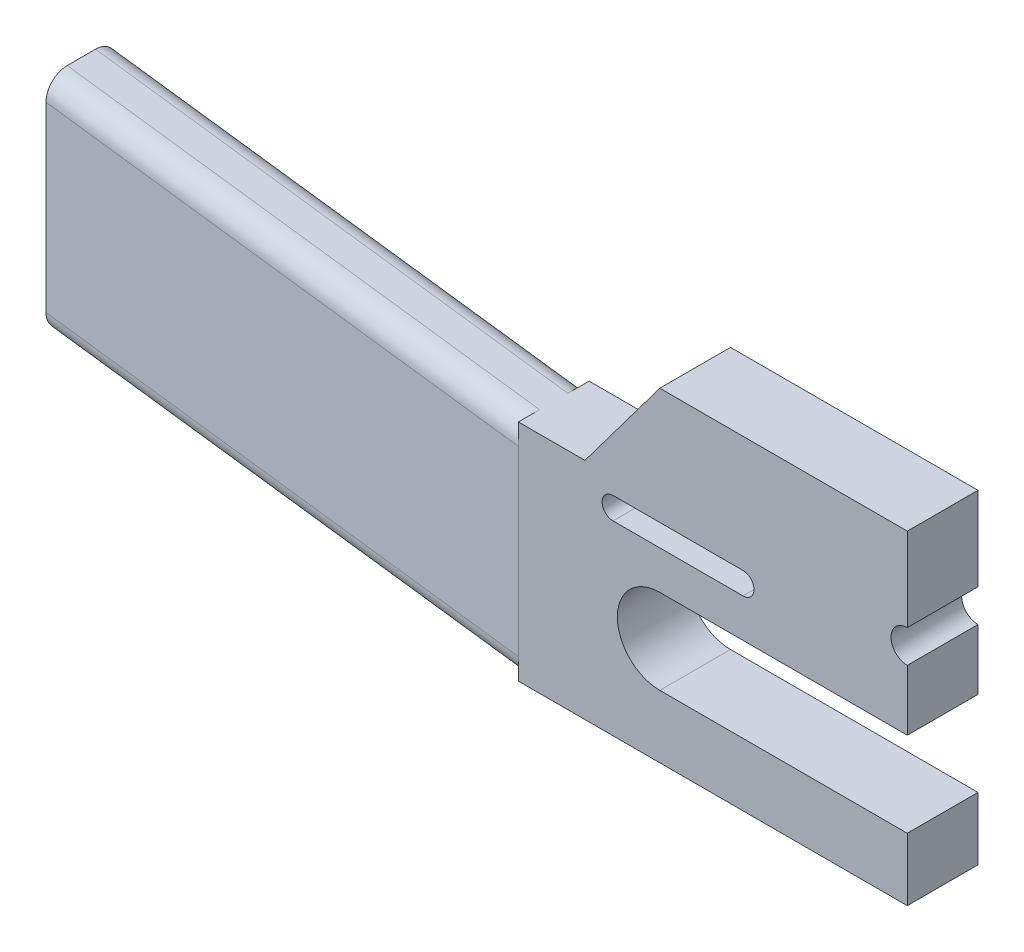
ISO-10303-21;
HEADER;
FILE_DESCRIPTION(('STEP AP214'),'2;1');
FILE_NAME('part.step','',(''),(''),'','','');
FILE_SCHEMA(('AUTOMOTIVE_DESIGN { 1 0 10303 214 1 1 1 1 }'));
ENDSEC;
DATA;
#1=APPLICATION_CONTEXT('core data for automotive mechanical design processes');
#2=APPLICATION_PROTOCOL_DEFINITION('international standard','automotive_design',2000,#1);
#3=PRODUCT_CONTEXT('',#1,'mechanical');
#4=PRODUCT('Part','Part','',(#3));
#5=PRODUCT_RELATED_PRODUCT_CATEGORY('part','',(#4));
#6=PRODUCT_DEFINITION_FORMATION('','',#4);
#7=PRODUCT_DEFINITION_CONTEXT('part definition',#1,'design');
#8=PRODUCT_DEFINITION('design','',#6,#7);
#9=PRODUCT_DEFINITION_SHAPE('','',#8);
#10=(LENGTH_UNIT() NAMED_UNIT(*) SI_UNIT(.MILLI.,.METRE.));
#11=(NAMED_UNIT(*) PLANE_ANGLE_UNIT() SI_UNIT($,.RADIAN.));
#12=(NAMED_UNIT(*) SI_UNIT($,.STERADIAN.) SOLID_ANGLE_UNIT());
#13=UNCERTAINTY_MEASURE_WITH_UNIT(LENGTH_MEASURE(1.E-05),#10,'distance_accuracy_value','');
#14=(GEOMETRIC_REPRESENTATION_CONTEXT(3) GLOBAL_UNCERTAINTY_ASSIGNED_CONTEXT((#13)) GLOBAL_UNIT_ASSIGNED_CONTEXT((#10,
#11,#12)) REPRESENTATION_CONTEXT('',''));
#15=CARTESIAN_POINT('',(0.,0.,0.));
#16=DIRECTION('',(0.,0.,1.));
#17=DIRECTION('',(1.,0.,0.));
#18=AXIS2_PLACEMENT_3D('',#15,#16,#17);
#19=CARTESIAN_POINT('',(-42.9289137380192,18.7333231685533,10.));
#20=DIRECTION('',(1.,0.,0.));
#21=DIRECTION('',(0.,1.,0.));
#22=AXIS2_PLACEMENT_3D('',#19,#20,#21);
#23=PLANE('',#22);
#24=DIRECTION('',(0.,0.,-1.));
#25=VECTOR('',#24,1.);
#26=CARTESIAN_POINT('',(-42.9289137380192,18.7333231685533,10.));
#27=LINE('',#26,#25);
#28=CARTESIAN_POINT('',(-42.9289137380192,18.7333231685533,10.));
#29=VERTEX_POINT('',#28);
#30=CARTESIAN_POINT('',(-42.9289137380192,18.7333231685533,6.99999999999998));
#31=VERTEX_POINT('',#30);
#32=EDGE_CURVE('E665',#29,#31,#27,.T.);
#33=ORIENTED_EDGE('',*,*,#32,.T.);
#34=CARTESIAN_POINT('',(-42.9289137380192,15.7333231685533,10.));
#35=CARTESIAN_POINT('',(-42.9289137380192,15.8177030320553,10.0000080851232));
#36=CARTESIAN_POINT('',(-42.9289137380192,15.9020790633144,9.99644004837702));
#37=CARTESIAN_POINT('',(-42.9289137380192,16.0702274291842,9.98221429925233));
#38=CARTESIAN_POINT('',(-42.9289137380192,16.1539997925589,9.97155692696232));
#39=CARTESIAN_POINT('',(-42.9289137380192,16.3202901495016,9.94322577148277));
#40=CARTESIAN_POINT('',(-42.9289137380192,16.4028090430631,9.92555729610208));
#41=CARTESIAN_POINT('',(-42.9289137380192,16.5660449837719,9.8833472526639));
#42=CARTESIAN_POINT('',(-42.9289137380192,16.6467620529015,9.85880576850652));
#43=CARTESIAN_POINT('',(-42.9289137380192,16.8854317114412,9.77507005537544));
#44=CARTESIAN_POINT('',(-42.9289137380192,17.0399704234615,9.70575297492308));
#45=CARTESIAN_POINT('',(-42.9289137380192,17.3351033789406,9.54220373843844));
#46=CARTESIAN_POINT('',(-42.9289137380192,17.4757000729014,9.44797597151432));
#47=CARTESIAN_POINT('',(-42.9289137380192,17.7391018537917,9.23724864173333));
#48=CARTESIAN_POINT('',(-42.9289137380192,17.8619071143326,9.12074929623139));
#49=CARTESIAN_POINT('',(-42.9289137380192,18.0862344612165,8.86876200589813));
#50=CARTESIAN_POINT('',(-42.9289137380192,18.1877523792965,8.73327035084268));
#51=CARTESIAN_POINT('',(-42.9289137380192,18.3666153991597,8.44715266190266));
#52=CARTESIAN_POINT('',(-42.9289137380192,18.4439557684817,8.2965236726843));
#53=CARTESIAN_POINT('',(-42.9289137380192,18.5722097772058,7.9844490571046));
#54=CARTESIAN_POINT('',(-42.9289137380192,18.6231388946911,7.82300982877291));
#55=CARTESIAN_POINT('',(-42.9289137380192,18.6844685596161,7.55048555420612));
#56=CARTESIAN_POINT('',(-42.9289137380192,18.7027779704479,7.44111489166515));
#57=CARTESIAN_POINT('',(-42.9289137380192,18.7272036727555,7.22117810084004));
#58=CARTESIAN_POINT('',(-42.9289137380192,18.7333372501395,7.11061389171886));
#59=CARTESIAN_POINT('',(-42.9289137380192,18.7333231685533,7.00000000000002));
#60=B_SPLINE_CURVE_WITH_KNOTS('',3,(#34,#35,#36,#37,#38,#39,#40,#41,#42,#43,#44,#45,#46,#47,#48,
#49,#50,#51,#52,#53,#54,#55,#56,#57,#58,#59),.UNSPECIFIED.,.F.,.F.,(4,2,2,2,2,2,2,2,2,2,2,2,4),
(0.,0.253057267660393,0.506102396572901,0.758956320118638,1.01180715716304,1.51730545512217,
2.02271474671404,2.52811910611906,3.03362233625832,3.53922445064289,4.04452992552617,
4.37657668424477,4.70815170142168),.UNSPECIFIED.);
#61=CARTESIAN_POINT('',(-42.9289137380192,15.7333231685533,10.));
#62=VERTEX_POINT('',#61);
#63=EDGE_CURVE('E541',#62,#31,#60,.T.);
#64=ORIENTED_EDGE('',*,*,#63,.F.);
#65=DIRECTION('',(0.,-1.,0.));
#66=VECTOR('',#65,1.);
#67=CARTESIAN_POINT('',(-42.9289137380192,18.7333231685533,10.));
#68=LINE('',#67,#66);
#69=EDGE_CURVE('E642',#29,#62,#68,.T.);
#70=ORIENTED_EDGE('',*,*,#69,.F.);
#71=EDGE_LOOP('',(#33,#64,#70));
#72=FACE_BOUND('',#71,.T.);
#73=ADVANCED_FACE('F354',(#72),#23,.F.);
#74=CARTESIAN_POINT('',(-42.9289137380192,-10.0131929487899,10.));
#75=VERTEX_POINT('',#74);
#76=CARTESIAN_POINT('',(-42.9289137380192,-13.0131929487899,10.));
#77=VERTEX_POINT('',#76);
#78=EDGE_CURVE('E641',#75,#77,#68,.T.);
#79=ORIENTED_EDGE('',*,*,#78,.F.);
#80=CARTESIAN_POINT('',(-42.9289137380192,-13.0131929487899,6.99999999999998));
#81=CARTESIAN_POINT('',(-42.9289137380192,-13.0132010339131,7.08437986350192));
#82=CARTESIAN_POINT('',(-42.9289137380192,-13.0096329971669,7.16875589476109));
#83=CARTESIAN_POINT('',(-42.9289137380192,-12.9954072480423,7.33690426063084));
#84=CARTESIAN_POINT('',(-42.9289137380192,-12.9847498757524,7.42067662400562));
#85=CARTESIAN_POINT('',(-42.9289137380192,-12.9564187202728,7.58696698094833));
#86=CARTESIAN_POINT('',(-42.9289137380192,-12.9387502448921,7.66948587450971));
#87=CARTESIAN_POINT('',(-42.9289137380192,-12.8965402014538,7.83272181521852));
#88=CARTESIAN_POINT('',(-42.9289137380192,-12.8719987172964,7.91343888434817));
#89=CARTESIAN_POINT('',(-42.9289137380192,-12.7882630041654,8.15210854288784));
#90=CARTESIAN_POINT('',(-42.9289137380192,-12.718945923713,8.30664725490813));
#91=CARTESIAN_POINT('',(-42.9289137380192,-12.5553966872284,8.60178021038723));
#92=CARTESIAN_POINT('',(-42.9289137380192,-12.4611689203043,8.74237690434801));
#93=CARTESIAN_POINT('',(-42.9289137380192,-12.2504415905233,9.00577868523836));
#94=CARTESIAN_POINT('',(-42.9289137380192,-12.1339422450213,9.12858394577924));
#95=CARTESIAN_POINT('',(-42.9289137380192,-11.8819549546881,9.35291129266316));
#96=CARTESIAN_POINT('',(-42.9289137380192,-11.7464632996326,9.45442921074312));
#97=CARTESIAN_POINT('',(-42.9289137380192,-11.4603456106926,9.63329223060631));
#98=CARTESIAN_POINT('',(-42.9289137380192,-11.3097166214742,9.71063259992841));
#99=CARTESIAN_POINT('',(-42.9289137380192,-10.9976420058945,9.83888660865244));
#100=CARTESIAN_POINT('',(-42.9289137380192,-10.8362027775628,9.88981572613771));
#101=CARTESIAN_POINT('',(-42.9289137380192,-10.5636785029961,9.95114539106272));
#102=CARTESIAN_POINT('',(-42.9289137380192,-10.4543078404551,9.96945480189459));
#103=CARTESIAN_POINT('',(-42.9289137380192,-10.23437104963,9.99388050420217));
#104=CARTESIAN_POINT('',(-42.9289137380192,-10.1238068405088,10.0000140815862));
#105=CARTESIAN_POINT('',(-42.9289137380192,-10.01319294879,10.));
#106=B_SPLINE_CURVE_WITH_KNOTS('',3,(#80,#81,#82,#83,#84,#85,#86,#87,#88,#89,#90,#91,#92,#93,
#94,#95,#96,#97,#98,#99,#100,#101,#102,#103,#104,#105),.UNSPECIFIED.,.F.,.F.,(4,2,2,2,2,2,2,2,2,
2,2,2,4),(0.,0.253057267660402,0.506102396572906,0.758956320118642,1.01180715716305,
1.51730545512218,2.02271474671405,2.52811910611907,3.03362233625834,3.5392244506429,
4.04452992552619,4.37657668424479,4.7081517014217),.UNSPECIFIED.);
#107=CARTESIAN_POINT('',(-42.9289137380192,-13.0131929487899,6.99999999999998));
#108=VERTEX_POINT('',#107);
#109=EDGE_CURVE('E689',#108,#75,#106,.T.);
#110=ORIENTED_EDGE('',*,*,#109,.F.);
#111=DIRECTION('',(0.,0.,-1.));
#112=VECTOR('',#111,1.);
#113=CARTESIAN_POINT('',(-42.9289137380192,-13.0131929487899,10.));
#114=LINE('',#113,#112);
#115=EDGE_CURVE('E661',#77,#108,#114,.T.);
#116=ORIENTED_EDGE('',*,*,#115,.F.);
#117=EDGE_LOOP('',(#79,#110,#116));
#118=FACE_BOUND('',#117,.T.);
#119=ADVANCED_FACE('F788',(#118),#23,.F.);
#120=CARTESIAN_POINT('',(-42.9289137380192,-13.0131929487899,3.00000000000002));
#121=VERTEX_POINT('',#120);
#122=CARTESIAN_POINT('',(-42.9289137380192,-13.0131929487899,0.));
#123=VERTEX_POINT('',#122);
#124=EDGE_CURVE('E660',#121,#123,#114,.T.);
#125=ORIENTED_EDGE('',*,*,#124,.F.);
#126=CARTESIAN_POINT('',(-42.9289137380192,-10.0131929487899,0.));
#127=CARTESIAN_POINT('',(-42.9289137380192,-10.0975728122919,-8.08512322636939E-06));
#128=CARTESIAN_POINT('',(-42.9289137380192,-10.181948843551,0.00355995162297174));
#129=CARTESIAN_POINT('',(-42.9289137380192,-10.3500972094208,0.017785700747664));
#130=CARTESIAN_POINT('',(-42.9289137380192,-10.4338695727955,0.0284430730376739));
#131=CARTESIAN_POINT('',(-42.9289137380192,-10.6001599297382,0.0567742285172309));
#132=CARTESIAN_POINT('',(-42.9289137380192,-10.6826788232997,0.0744427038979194));
#133=CARTESIAN_POINT('',(-42.9289137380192,-10.8459147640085,0.116652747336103));
#134=CARTESIAN_POINT('',(-42.9289137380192,-10.9266318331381,0.141194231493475));
#135=CARTESIAN_POINT('',(-42.9289137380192,-11.1653014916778,0.224929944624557));
#136=CARTESIAN_POINT('',(-42.9289137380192,-11.3198402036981,0.29424702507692));
#137=CARTESIAN_POINT('',(-42.9289137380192,-11.6149731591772,0.457796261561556));
#138=CARTESIAN_POINT('',(-42.9289137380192,-11.7555698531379,0.552024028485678));
#139=CARTESIAN_POINT('',(-42.9289137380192,-12.0189716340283,0.762751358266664));
#140=CARTESIAN_POINT('',(-42.9289137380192,-12.1417768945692,0.879250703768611));
#141=CARTESIAN_POINT('',(-42.9289137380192,-12.3661042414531,1.13123799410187));
#142=CARTESIAN_POINT('',(-42.9289137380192,-12.4676221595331,1.26672964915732));
#143=CARTESIAN_POINT('',(-42.9289137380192,-12.6464851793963,1.55284733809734));
#144=CARTESIAN_POINT('',(-42.9289137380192,-12.7238255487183,1.7034763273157));
#145=CARTESIAN_POINT('',(-42.9289137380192,-12.8520795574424,2.0155509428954));
#146=CARTESIAN_POINT('',(-42.9289137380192,-12.9030086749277,2.1769901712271));
#147=CARTESIAN_POINT('',(-42.9289137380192,-12.9643383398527,2.44951444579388));
#148=CARTESIAN_POINT('',(-42.9289137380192,-12.9826477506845,2.55888510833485));
#149=CARTESIAN_POINT('',(-42.9289137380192,-13.0070734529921,2.77882189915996));
#150=CARTESIAN_POINT('',(-42.9289137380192,-13.0132070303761,2.88938610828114));
#151=CARTESIAN_POINT('',(-42.9289137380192,-13.0131929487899,2.99999999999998));
#152=B_SPLINE_CURVE_WITH_KNOTS('',3,(#126,#127,#128,#129,#130,#131,#132,#133,#134,#135,#136,
#137,#138,#139,#140,#141,#142,#143,#144,#145,#146,#147,#148,#149,#150,#151),.UNSPECIFIED.,.F.,
.F.,(4,2,2,2,2,2,2,2,2,2,2,2,4),(0.,0.253057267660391,0.506102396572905,0.758956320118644,
1.01180715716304,1.51730545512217,2.02271474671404,2.52811910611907,3.03362233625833,
3.53922445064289,4.04452992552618,4.37657668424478,4.70815170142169),.UNSPECIFIED.);
#153=CARTESIAN_POINT('',(-42.9289137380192,-10.0131929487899,0.));
#154=VERTEX_POINT('',#153);
#155=EDGE_CURVE('E562',#154,#121,#152,.T.);
#156=ORIENTED_EDGE('',*,*,#155,.F.);
#157=DIRECTION('',(0.,-1.,0.));
#158=VECTOR('',#157,1.);
#159=CARTESIAN_POINT('',(-42.9289137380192,18.7333231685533,0.));
#160=LINE('',#159,#158);
#161=EDGE_CURVE('E614',#154,#123,#160,.T.);
#162=ORIENTED_EDGE('',*,*,#161,.T.);
#163=EDGE_LOOP('',(#125,#156,#162));
#164=FACE_BOUND('',#163,.T.);
#165=ADVANCED_FACE('F776',(#164),#23,.F.);
#166=CARTESIAN_POINT('',(-22.9289137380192,1.86134185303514,10.));
#167=DIRECTION('',(0.,0.,1.));
#168=DIRECTION('',(1.,0.,0.));
#169=AXIS2_PLACEMENT_3D('',#166,#167,#168);
#170=PLANE('',#169);
#171=CARTESIAN_POINT('',(-22.9289137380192,1.86134185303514,10.));
#172=DIRECTION('',(0.,0.,-1.));
#173=DIRECTION('',(1.,0.,0.));
#174=AXIS2_PLACEMENT_3D('',#171,#172,#173);
#175=CIRCLE('',#174,6.);
#176=CARTESIAN_POINT('',(-22.9289137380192,-4.13865814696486,10.));
#177=VERTEX_POINT('',#176);
#178=CARTESIAN_POINT('',(-22.9289137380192,7.86134185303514,10.));
#179=VERTEX_POINT('',#178);
#180=EDGE_CURVE('E624',#177,#179,#175,.T.);
#181=ORIENTED_EDGE('',*,*,#180,.T.);
#182=DIRECTION('',(1.,0.,0.));
#183=VECTOR('',#182,1.);
#184=CARTESIAN_POINT('',(-22.9289137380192,7.86134185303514,10.));
#185=LINE('',#184,#183);
#186=CARTESIAN_POINT('',(12.0710862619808,7.86134185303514,10.));
#187=VERTEX_POINT('',#186);
#188=EDGE_CURVE('E627',#179,#187,#185,.T.);
#189=ORIENTED_EDGE('',*,*,#188,.T.);
#190=DIRECTION('',(0.,1.,0.));
#191=VECTOR('',#190,1.);
#192=CARTESIAN_POINT('',(12.0710862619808,7.86134185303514,10.));
#193=LINE('',#192,#191);
#194=CARTESIAN_POINT('',(12.0710862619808,16.4235089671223,10.));
#195=VERTEX_POINT('',#194);
#196=EDGE_CURVE('E629',#187,#195,#193,.T.);
#197=ORIENTED_EDGE('',*,*,#196,.T.);
#198=CARTESIAN_POINT('',(12.0710862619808,18.7333231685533,10.));
#199=DIRECTION('',(0.,0.,-1.));
#200=DIRECTION('',(1.,0.,0.));
#201=AXIS2_PLACEMENT_3D('',#198,#199,#200);
#202=CIRCLE('',#201,2.30981420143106);
#203=CARTESIAN_POINT('',(12.0710862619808,21.0431373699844,10.));
#204=VERTEX_POINT('',#203);
#205=EDGE_CURVE('E631',#195,#204,#202,.T.);
#206=ORIENTED_EDGE('',*,*,#205,.T.);
#207=DIRECTION('',(0.,1.,0.));
#208=VECTOR('',#207,1.);
#209=CARTESIAN_POINT('',(12.0710862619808,21.0431373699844,10.));
#210=LINE('',#209,#208);
#211=CARTESIAN_POINT('',(12.0710862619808,32.8613418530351,10.));
#212=VERTEX_POINT('',#211);
#213=EDGE_CURVE('E633',#204,#212,#210,.T.);
#214=ORIENTED_EDGE('',*,*,#213,.T.);
#215=DIRECTION('',(-1.,0.,0.));
#216=VECTOR('',#215,1.);
#217=CARTESIAN_POINT('',(12.0710862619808,32.8613418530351,10.));
#218=LINE('',#217,#216);
#219=CARTESIAN_POINT('',(-22.9289137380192,32.8613418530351,10.));
#220=VERTEX_POINT('',#219);
#221=EDGE_CURVE('E635',#212,#220,#218,.T.);
#222=ORIENTED_EDGE('',*,*,#221,.T.);
#223=DIRECTION('',(-0.599451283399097,-0.800411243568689,0.));
#224=VECTOR('',#223,1.);
#225=CARTESIAN_POINT('',(-22.9289137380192,32.8613418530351,10.));
#226=LINE('',#225,#224);
#227=CARTESIAN_POINT('',(-33.5097982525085,18.7333231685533,10.));
#228=VERTEX_POINT('',#227);
#229=EDGE_CURVE('E637',#220,#228,#226,.T.);
#230=ORIENTED_EDGE('',*,*,#229,.T.);
#231=DIRECTION('',(-1.,0.,0.));
#232=VECTOR('',#231,1.);
#233=CARTESIAN_POINT('',(-33.5097982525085,18.7333231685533,10.));
#234=LINE('',#233,#232);
#235=EDGE_CURVE('E639',#228,#29,#234,.T.);
#236=ORIENTED_EDGE('',*,*,#235,.T.);
#237=ORIENTED_EDGE('',*,*,#69,.T.);
#238=DIRECTION('',(0.,1.,0.));
#239=VECTOR('',#238,1.);
#240=CARTESIAN_POINT('',(-42.9289137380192,15.7333231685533,10.));
#241=LINE('',#240,#239);
#242=EDGE_CURVE('E537',#75,#62,#241,.T.);
#243=ORIENTED_EDGE('',*,*,#242,.F.);
#244=ORIENTED_EDGE('',*,*,#78,.T.);
#245=DIRECTION('',(1.,0.,0.));
#246=VECTOR('',#245,1.);
#247=CARTESIAN_POINT('',(12.0710862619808,-13.0131929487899,10.));
#248=LINE('',#247,#246);
#249=CARTESIAN_POINT('',(12.0710862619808,-13.0131929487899,10.));
#250=VERTEX_POINT('',#249);
#251=EDGE_CURVE('E645',#77,#250,#248,.T.);
#252=ORIENTED_EDGE('',*,*,#251,.T.);
#253=DIRECTION('',(0.,1.,0.));
#254=VECTOR('',#253,1.);
#255=CARTESIAN_POINT('',(12.0710862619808,-4.13865814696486,10.));
#256=LINE('',#255,#254);
#257=CARTESIAN_POINT('',(12.0710862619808,-4.13865814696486,10.));
#258=VERTEX_POINT('',#257);
#259=EDGE_CURVE('E647',#250,#258,#256,.T.);
#260=ORIENTED_EDGE('',*,*,#259,.T.);
#261=DIRECTION('',(-1.,0.,0.));
#262=VECTOR('',#261,1.);
#263=CARTESIAN_POINT('',(-22.9289137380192,-4.13865814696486,10.));
#264=LINE('',#263,#262);
#265=EDGE_CURVE('E649',#258,#177,#264,.T.);
#266=ORIENTED_EDGE('',*,*,#265,.T.);
#267=EDGE_LOOP('',(#181,#189,#197,#206,#214,#222,#230,#236,#237,#243,#244,#252,#260,#266));
#268=FACE_BOUND('',#267,.T.);
#269=DIRECTION('',(1.,0.,0.));
#270=VECTOR('',#269,1.);
#271=CARTESIAN_POINT('',(-29.5347691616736,13.3079456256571,10.));
#272=LINE('',#271,#270);
#273=CARTESIAN_POINT('',(-29.5347691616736,13.3079456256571,10.));
#274=VERTEX_POINT('',#273);
#275=CARTESIAN_POINT('',(-11.1636887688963,13.3079456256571,10.));
#276=VERTEX_POINT('',#275);
#277=EDGE_CURVE('E580',#274,#276,#272,.T.);
#278=ORIENTED_EDGE('',*,*,#277,.F.);
#279=CARTESIAN_POINT('',(-29.5347691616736,14.8657272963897,10.));
#280=DIRECTION('',(0.,0.,1.));
#281=DIRECTION('',(1.,0.,0.));
#282=AXIS2_PLACEMENT_3D('',#279,#280,#281);
#283=CIRCLE('',#282,1.55778167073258);
#284=CARTESIAN_POINT('',(-29.5347691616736,16.4235089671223,10.));
#285=VERTEX_POINT('',#284);
#286=EDGE_CURVE('E578',#285,#274,#283,.T.);
#287=ORIENTED_EDGE('',*,*,#286,.F.);
#288=DIRECTION('',(-1.,0.,0.));
#289=VECTOR('',#288,1.);
#290=CARTESIAN_POINT('',(-29.5347691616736,16.4235089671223,10.));
#291=LINE('',#290,#289);
#292=CARTESIAN_POINT('',(-11.1636887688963,16.4235089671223,10.));
#293=VERTEX_POINT('',#292);
#294=EDGE_CURVE('E585',#293,#285,#291,.T.);
#295=ORIENTED_EDGE('',*,*,#294,.F.);
#296=CARTESIAN_POINT('',(-11.1636887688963,14.8657272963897,10.));
#297=DIRECTION('',(0.,0.,1.));
#298=DIRECTION('',(-1.,0.,0.));
#299=AXIS2_PLACEMENT_3D('',#296,#297,#298);
#300=CIRCLE('',#299,1.55778167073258);
#301=EDGE_CURVE('E582',#276,#293,#300,.T.);
#302=ORIENTED_EDGE('',*,*,#301,.F.);
#303=EDGE_LOOP('',(#278,#287,#295,#302));
#304=FACE_BOUND('',#303,.T.);
#305=ADVANCED_FACE('F752',(#268,#304),#170,.T.);
#306=CARTESIAN_POINT('',(-22.9289137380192,1.86134185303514,0.));
#307=DIRECTION('',(0.,0.,1.));
#308=DIRECTION('',(1.,0.,0.));
#309=AXIS2_PLACEMENT_3D('',#306,#307,#308);
#310=PLANE('',#309);
#311=CARTESIAN_POINT('',(-22.9289137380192,1.86134185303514,0.));
#312=DIRECTION('',(0.,0.,-1.));
#313=DIRECTION('',(1.,0.,0.));
#314=AXIS2_PLACEMENT_3D('',#311,#312,#313);
#315=CIRCLE('',#314,6.);
#316=CARTESIAN_POINT('',(-22.9289137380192,-4.13865814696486,0.));
#317=VERTEX_POINT('',#316);
#318=CARTESIAN_POINT('',(-22.9289137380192,7.86134185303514,0.));
#319=VERTEX_POINT('',#318);
#320=EDGE_CURVE('E597',#317,#319,#315,.T.);
#321=ORIENTED_EDGE('',*,*,#320,.F.);
#322=DIRECTION('',(-1.,0.,0.));
#323=VECTOR('',#322,1.);
#324=CARTESIAN_POINT('',(-22.9289137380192,-4.13865814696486,0.));
#325=LINE('',#324,#323);
#326=CARTESIAN_POINT('',(12.0710862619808,-4.13865814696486,0.));
#327=VERTEX_POINT('',#326);
#328=EDGE_CURVE('E622',#327,#317,#325,.T.);
#329=ORIENTED_EDGE('',*,*,#328,.F.);
#330=DIRECTION('',(0.,1.,0.));
#331=VECTOR('',#330,1.);
#332=CARTESIAN_POINT('',(12.0710862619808,-4.13865814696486,0.));
#333=LINE('',#332,#331);
#334=CARTESIAN_POINT('',(12.0710862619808,-13.0131929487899,0.));
#335=VERTEX_POINT('',#334);
#336=EDGE_CURVE('E620',#335,#327,#333,.T.);
#337=ORIENTED_EDGE('',*,*,#336,.F.);
#338=DIRECTION('',(1.,0.,0.));
#339=VECTOR('',#338,1.);
#340=CARTESIAN_POINT('',(12.0710862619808,-13.0131929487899,0.));
#341=LINE('',#340,#339);
#342=EDGE_CURVE('E618',#123,#335,#341,.T.);
#343=ORIENTED_EDGE('',*,*,#342,.F.);
#344=ORIENTED_EDGE('',*,*,#161,.F.);
#345=DIRECTION('',(0.,-1.,0.));
#346=VECTOR('',#345,1.);
#347=CARTESIAN_POINT('',(-42.9289137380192,15.7333231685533,0.));
#348=LINE('',#347,#346);
#349=CARTESIAN_POINT('',(-42.9289137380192,15.7333231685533,0.));
#350=VERTEX_POINT('',#349);
#351=EDGE_CURVE('E560',#350,#154,#348,.T.);
#352=ORIENTED_EDGE('',*,*,#351,.F.);
#353=CARTESIAN_POINT('',(-42.9289137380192,18.7333231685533,0.));
#354=VERTEX_POINT('',#353);
#355=EDGE_CURVE('E617',#354,#350,#160,.T.);
#356=ORIENTED_EDGE('',*,*,#355,.F.);
#357=DIRECTION('',(-1.,0.,0.));
#358=VECTOR('',#357,1.);
#359=CARTESIAN_POINT('',(-33.5097982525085,18.7333231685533,0.));
#360=LINE('',#359,#358);
#361=CARTESIAN_POINT('',(-33.5097982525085,18.7333231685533,0.));
#362=VERTEX_POINT('',#361);
#363=EDGE_CURVE('E612',#362,#354,#360,.T.);
#364=ORIENTED_EDGE('',*,*,#363,.F.);
#365=DIRECTION('',(-0.599451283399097,-0.800411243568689,0.));
#366=VECTOR('',#365,1.);
#367=CARTESIAN_POINT('',(-22.9289137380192,32.8613418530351,0.));
#368=LINE('',#367,#366);
#369=CARTESIAN_POINT('',(-22.9289137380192,32.8613418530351,0.));
#370=VERTEX_POINT('',#369);
#371=EDGE_CURVE('E610',#370,#362,#368,.T.);
#372=ORIENTED_EDGE('',*,*,#371,.F.);
#373=DIRECTION('',(-1.,0.,0.));
#374=VECTOR('',#373,1.);
#375=CARTESIAN_POINT('',(12.0710862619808,32.8613418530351,0.));
#376=LINE('',#375,#374);
#377=CARTESIAN_POINT('',(12.0710862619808,32.8613418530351,0.));
#378=VERTEX_POINT('',#377);
#379=EDGE_CURVE('E608',#378,#370,#376,.T.);
#380=ORIENTED_EDGE('',*,*,#379,.F.);
#381=DIRECTION('',(0.,1.,0.));
#382=VECTOR('',#381,1.);
#383=CARTESIAN_POINT('',(12.0710862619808,21.0431373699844,0.));
#384=LINE('',#383,#382);
#385=CARTESIAN_POINT('',(12.0710862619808,21.0431373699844,0.));
#386=VERTEX_POINT('',#385);
#387=EDGE_CURVE('E606',#386,#378,#384,.T.);
#388=ORIENTED_EDGE('',*,*,#387,.F.);
#389=CARTESIAN_POINT('',(12.0710862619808,18.7333231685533,0.));
#390=DIRECTION('',(0.,0.,-1.));
#391=DIRECTION('',(1.,0.,0.));
#392=AXIS2_PLACEMENT_3D('',#389,#390,#391);
#393=CIRCLE('',#392,2.30981420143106);
#394=CARTESIAN_POINT('',(12.0710862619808,16.4235089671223,0.));
#395=VERTEX_POINT('',#394);
#396=EDGE_CURVE('E604',#395,#386,#393,.T.);
#397=ORIENTED_EDGE('',*,*,#396,.F.);
#398=DIRECTION('',(0.,1.,0.));
#399=VECTOR('',#398,1.);
#400=CARTESIAN_POINT('',(12.0710862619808,7.86134185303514,0.));
#401=LINE('',#400,#399);
#402=CARTESIAN_POINT('',(12.0710862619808,7.86134185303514,0.));
#403=VERTEX_POINT('',#402);
#404=EDGE_CURVE('E602',#403,#395,#401,.T.);
#405=ORIENTED_EDGE('',*,*,#404,.F.);
#406=DIRECTION('',(1.,0.,0.));
#407=VECTOR('',#406,1.);
#408=CARTESIAN_POINT('',(-22.9289137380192,7.86134185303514,0.));
#409=LINE('',#408,#407);
#410=EDGE_CURVE('E600',#319,#403,#409,.T.);
#411=ORIENTED_EDGE('',*,*,#410,.F.);
#412=EDGE_LOOP('',(#321,#329,#337,#343,#344,#352,#356,#364,#372,#380,#388,#397,#405,#411));
#413=FACE_BOUND('',#412,.T.);
#414=CARTESIAN_POINT('',(-29.5347691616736,14.8657272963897,0.));
#415=DIRECTION('',(0.,0.,1.));
#416=DIRECTION('',(1.,0.,0.));
#417=AXIS2_PLACEMENT_3D('',#414,#415,#416);
#418=CIRCLE('',#417,1.55778167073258);
#419=CARTESIAN_POINT('',(-29.5347691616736,16.4235089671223,0.));
#420=VERTEX_POINT('',#419);
#421=CARTESIAN_POINT('',(-29.5347691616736,13.3079456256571,0.));
#422=VERTEX_POINT('',#421);
#423=EDGE_CURVE('E543',#420,#422,#418,.T.);
#424=ORIENTED_EDGE('',*,*,#423,.T.);
#425=DIRECTION('',(1.,0.,0.));
#426=VECTOR('',#425,1.);
#427=CARTESIAN_POINT('',(-29.5347691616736,13.3079456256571,0.));
#428=LINE('',#427,#426);
#429=CARTESIAN_POINT('',(-11.1636887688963,13.3079456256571,0.));
#430=VERTEX_POINT('',#429);
#431=EDGE_CURVE('E546',#422,#430,#428,.T.);
#432=ORIENTED_EDGE('',*,*,#431,.T.);
#433=CARTESIAN_POINT('',(-11.1636887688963,14.8657272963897,0.));
#434=DIRECTION('',(0.,0.,1.));
#435=DIRECTION('',(-1.,0.,0.));
#436=AXIS2_PLACEMENT_3D('',#433,#434,#435);
#437=CIRCLE('',#436,1.55778167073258);
#438=CARTESIAN_POINT('',(-11.1636887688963,16.4235089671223,0.));
#439=VERTEX_POINT('',#438);
#440=EDGE_CURVE('E572',#430,#439,#437,.T.);
#441=ORIENTED_EDGE('',*,*,#440,.T.);
#442=DIRECTION('',(-1.,0.,0.));
#443=VECTOR('',#442,1.);
#444=CARTESIAN_POINT('',(-29.5347691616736,16.4235089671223,0.));
#445=LINE('',#444,#443);
#446=EDGE_CURVE('E575',#439,#420,#445,.T.);
#447=ORIENTED_EDGE('',*,*,#446,.T.);
#448=EDGE_LOOP('',(#424,#432,#441,#447));
#449=FACE_BOUND('',#448,.T.);
#450=ADVANCED_FACE('F763',(#413,#449),#310,.F.);
#451=CARTESIAN_POINT('',(-22.9289137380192,1.86134185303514,10.));
#452=DIRECTION('',(0.,0.,-1.));
#453=DIRECTION('',(-1.,0.,0.));
#454=AXIS2_PLACEMENT_3D('',#451,#452,#453);
#455=CYLINDRICAL_SURFACE('',#454,6.);
#456=ORIENTED_EDGE('',*,*,#320,.T.);
#457=DIRECTION('',(0.,0.,-1.));
#458=VECTOR('',#457,1.);
#459=CARTESIAN_POINT('',(-22.9289137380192,7.86134185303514,10.));
#460=LINE('',#459,#458);
#461=EDGE_CURVE('E11',#179,#319,#460,.T.);
#462=ORIENTED_EDGE('',*,*,#461,.F.);
#463=ORIENTED_EDGE('',*,*,#180,.F.);
#464=DIRECTION('',(0.,0.,-1.));
#465=VECTOR('',#464,1.);
#466=CARTESIAN_POINT('',(-22.9289137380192,-4.13865814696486,10.));
#467=LINE('',#466,#465);
#468=EDGE_CURVE('E651',#177,#317,#467,.T.);
#469=ORIENTED_EDGE('',*,*,#468,.T.);
#470=EDGE_LOOP('',(#456,#462,#463,#469));
#471=FACE_BOUND('',#470,.T.);
#472=ADVANCED_FACE('F356',(#471),#455,.F.);
#473=CARTESIAN_POINT('',(-22.9289137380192,7.86134185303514,10.));
#474=DIRECTION('',(0.,1.,0.));
#475=DIRECTION('',(0.,0.,1.));
#476=AXIS2_PLACEMENT_3D('',#473,#474,#475);
#477=PLANE('',#476);
#478=ORIENTED_EDGE('',*,*,#410,.T.);
#479=DIRECTION('',(0.,0.,-1.));
#480=VECTOR('',#479,1.);
#481=CARTESIAN_POINT('',(12.0710862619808,7.86134185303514,10.));
#482=LINE('',#481,#480);
#483=EDGE_CURVE('E369',#187,#403,#482,.T.);
#484=ORIENTED_EDGE('',*,*,#483,.F.);
#485=ORIENTED_EDGE('',*,*,#188,.F.);
#486=ORIENTED_EDGE('',*,*,#461,.T.);
#487=EDGE_LOOP('',(#478,#484,#485,#486));
#488=FACE_BOUND('',#487,.T.);
#489=ADVANCED_FACE('F823',(#488),#477,.F.);
#490=CARTESIAN_POINT('',(12.0710862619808,7.86134185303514,10.));
#491=DIRECTION('',(-1.,0.,0.));
#492=DIRECTION('',(0.,0.,1.));
#493=AXIS2_PLACEMENT_3D('',#490,#491,#492);
#494=PLANE('',#493);
#495=ORIENTED_EDGE('',*,*,#404,.T.);
#496=DIRECTION('',(0.,0.,-1.));
#497=VECTOR('',#496,1.);
#498=CARTESIAN_POINT('',(12.0710862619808,16.4235089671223,10.));
#499=LINE('',#498,#497);
#500=EDGE_CURVE('E679',#195,#395,#499,.T.);
#501=ORIENTED_EDGE('',*,*,#500,.F.);
#502=ORIENTED_EDGE('',*,*,#196,.F.);
#503=ORIENTED_EDGE('',*,*,#483,.T.);
#504=EDGE_LOOP('',(#495,#501,#502,#503));
#505=FACE_BOUND('',#504,.T.);
#506=ADVANCED_FACE('F820',(#505),#494,.F.);
#507=CARTESIAN_POINT('',(12.0710862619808,18.7333231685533,10.));
#508=DIRECTION('',(0.,0.,-1.));
#509=DIRECTION('',(-1.,0.,0.));
#510=AXIS2_PLACEMENT_3D('',#507,#508,#509);
#511=CYLINDRICAL_SURFACE('',#510,2.30981420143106);
#512=ORIENTED_EDGE('',*,*,#396,.T.);
#513=DIRECTION('',(0.,0.,-1.));
#514=VECTOR('',#513,1.);
#515=CARTESIAN_POINT('',(12.0710862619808,21.0431373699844,10.));
#516=LINE('',#515,#514);
#517=EDGE_CURVE('E676',#204,#386,#516,.T.);
#518=ORIENTED_EDGE('',*,*,#517,.F.);
#519=ORIENTED_EDGE('',*,*,#205,.F.);
#520=ORIENTED_EDGE('',*,*,#500,.T.);
#521=EDGE_LOOP('',(#512,#518,#519,#520));
#522=FACE_BOUND('',#521,.T.);
#523=ADVANCED_FACE('F816',(#522),#511,.F.);
#524=CARTESIAN_POINT('',(12.0710862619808,21.0431373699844,10.));
#525=DIRECTION('',(-1.,0.,0.));
#526=DIRECTION('',(0.,0.,1.));
#527=AXIS2_PLACEMENT_3D('',#524,#525,#526);
#528=PLANE('',#527);
#529=ORIENTED_EDGE('',*,*,#387,.T.);
#530=DIRECTION('',(0.,0.,-1.));
#531=VECTOR('',#530,1.);
#532=CARTESIAN_POINT('',(12.0710862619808,32.8613418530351,10.));
#533=LINE('',#532,#531);
#534=EDGE_CURVE('E673',#212,#378,#533,.T.);
#535=ORIENTED_EDGE('',*,*,#534,.F.);
#536=ORIENTED_EDGE('',*,*,#213,.F.);
#537=ORIENTED_EDGE('',*,*,#517,.T.);
#538=EDGE_LOOP('',(#529,#535,#536,#537));
#539=FACE_BOUND('',#538,.T.);
#540=ADVANCED_FACE('F812',(#539),#528,.F.);
#541=CARTESIAN_POINT('',(12.0710862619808,32.8613418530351,10.));
#542=DIRECTION('',(0.,-1.,0.));
#543=DIRECTION('',(1.,0.,0.));
#544=AXIS2_PLACEMENT_3D('',#541,#542,#543);
#545=PLANE('',#544);
#546=ORIENTED_EDGE('',*,*,#379,.T.);
#547=DIRECTION('',(0.,0.,-1.));
#548=VECTOR('',#547,1.);
#549=CARTESIAN_POINT('',(-22.9289137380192,32.8613418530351,10.));
#550=LINE('',#549,#548);
#551=EDGE_CURVE('E670',#220,#370,#550,.T.);
#552=ORIENTED_EDGE('',*,*,#551,.F.);
#553=ORIENTED_EDGE('',*,*,#221,.F.);
#554=ORIENTED_EDGE('',*,*,#534,.T.);
#555=EDGE_LOOP('',(#546,#552,#553,#554));
#556=FACE_BOUND('',#555,.T.);
#557=ADVANCED_FACE('F807',(#556),#545,.F.);
#558=CARTESIAN_POINT('',(-22.9289137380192,32.8613418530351,10.));
#559=DIRECTION('',(0.800411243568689,-0.599451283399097,0.));
#560=DIRECTION('',(0.599451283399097,0.800411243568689,0.));
#561=AXIS2_PLACEMENT_3D('',#558,#559,#560);
#562=PLANE('',#561);
#563=ORIENTED_EDGE('',*,*,#371,.T.);
#564=DIRECTION('',(0.,0.,-1.));
#565=VECTOR('',#564,1.);
#566=CARTESIAN_POINT('',(-33.5097982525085,18.7333231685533,10.));
#567=LINE('',#566,#565);
#568=EDGE_CURVE('E667',#228,#362,#567,.T.);
#569=ORIENTED_EDGE('',*,*,#568,.F.);
#570=ORIENTED_EDGE('',*,*,#229,.F.);
#571=ORIENTED_EDGE('',*,*,#551,.T.);
#572=EDGE_LOOP('',(#563,#569,#570,#571));
#573=FACE_BOUND('',#572,.T.);
#574=ADVANCED_FACE('F802',(#573),#562,.F.);
#575=CARTESIAN_POINT('',(-33.5097982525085,18.7333231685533,10.));
#576=DIRECTION('',(0.,-1.,0.));
#577=DIRECTION('',(1.,0.,0.));
#578=AXIS2_PLACEMENT_3D('',#575,#576,#577);
#579=PLANE('',#578);
#580=ORIENTED_EDGE('',*,*,#363,.T.);
#581=CARTESIAN_POINT('',(-42.9289137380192,18.7333231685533,3.00000000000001));
#582=VERTEX_POINT('',#581);
#583=EDGE_CURVE('E664',#582,#354,#27,.T.);
#584=ORIENTED_EDGE('',*,*,#583,.F.);
#585=DIRECTION('',(0.993363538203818,0.,0.11501687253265));
#586=VECTOR('',#585,1.);
#587=CARTESIAN_POINT('',(-118.478517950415,18.7333231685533,-5.74753185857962));
#588=LINE('',#587,#586);
#589=CARTESIAN_POINT('',(-118.478517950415,18.7333231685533,-5.74753185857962));
#590=VERTEX_POINT('',#589);
#591=EDGE_CURVE('E377',#590,#582,#588,.T.);
#592=ORIENTED_EDGE('',*,*,#591,.F.);
#593=DIRECTION('',(0.,0.,-1.));
#594=VECTOR('',#593,1.);
#595=CARTESIAN_POINT('',(-118.478517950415,18.7333231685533,-1.74753185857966));
#596=LINE('',#595,#594);
#597=CARTESIAN_POINT('',(-118.478517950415,18.7333231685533,-1.74753185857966));
#598=VERTEX_POINT('',#597);
#599=EDGE_CURVE('E517',#598,#590,#596,.T.);
#600=ORIENTED_EDGE('',*,*,#599,.F.);
#601=DIRECTION('',(0.993363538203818,0.,0.11501687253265));
#602=VECTOR('',#601,1.);
#603=CARTESIAN_POINT('',(-118.478517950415,18.7333231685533,-1.74753185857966));
#604=LINE('',#603,#602);
#605=EDGE_CURVE('E523',#598,#31,#604,.T.);
#606=ORIENTED_EDGE('',*,*,#605,.T.);
#607=ORIENTED_EDGE('',*,*,#32,.F.);
#608=ORIENTED_EDGE('',*,*,#235,.F.);
#609=ORIENTED_EDGE('',*,*,#568,.T.);
#610=EDGE_LOOP('',(#580,#584,#592,#600,#606,#607,#608,#609));
#611=FACE_BOUND('',#610,.T.);
#612=ADVANCED_FACE('F520',(#611),#579,.F.);
#613=ORIENTED_EDGE('',*,*,#355,.T.);
#614=CARTESIAN_POINT('',(-42.9289137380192,18.7333231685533,3.));
#615=CARTESIAN_POINT('',(-42.9289137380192,18.7333312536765,2.91562013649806));
#616=CARTESIAN_POINT('',(-42.9289137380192,18.7297632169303,2.83124410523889));
#617=CARTESIAN_POINT('',(-42.9289137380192,18.7155374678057,2.66309573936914));
#618=CARTESIAN_POINT('',(-42.9289137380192,18.7048800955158,2.57932337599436));
#619=CARTESIAN_POINT('',(-42.9289137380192,18.6765489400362,2.41303301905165));
#620=CARTESIAN_POINT('',(-42.9289137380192,18.6588804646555,2.33051412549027));
#621=CARTESIAN_POINT('',(-42.9289137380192,18.6166704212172,2.16727818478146));
#622=CARTESIAN_POINT('',(-42.9289137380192,18.5921289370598,2.08656111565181));
#623=CARTESIAN_POINT('',(-42.9289137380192,18.5083932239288,1.84789145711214));
#624=CARTESIAN_POINT('',(-42.9289137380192,18.4390761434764,1.69335274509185));
#625=CARTESIAN_POINT('',(-42.9289137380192,18.2755269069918,1.39821978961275));
#626=CARTESIAN_POINT('',(-42.9289137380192,18.1812991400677,1.25762309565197));
#627=CARTESIAN_POINT('',(-42.9289137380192,17.9705718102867,0.994221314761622));
#628=CARTESIAN_POINT('',(-42.9289137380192,17.8540724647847,0.871416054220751));
#629=CARTESIAN_POINT('',(-42.9289137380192,17.6020851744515,0.647088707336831));
#630=CARTESIAN_POINT('',(-42.9289137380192,17.466593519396,0.545570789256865));
#631=CARTESIAN_POINT('',(-42.9289137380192,17.180475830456,0.366707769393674));
#632=CARTESIAN_POINT('',(-42.9289137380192,17.0298468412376,0.289367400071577));
#633=CARTESIAN_POINT('',(-42.9289137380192,16.7177722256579,0.161113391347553));
#634=CARTESIAN_POINT('',(-42.9289137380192,16.5563329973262,0.11018427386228));
#635=CARTESIAN_POINT('',(-42.9289137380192,16.2838087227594,0.0488546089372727));
#636=CARTESIAN_POINT('',(-42.9289137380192,16.1744380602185,0.0305451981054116));
#637=CARTESIAN_POINT('',(-42.9289137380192,15.9545012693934,0.00611949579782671));
#638=CARTESIAN_POINT('',(-42.9289137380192,15.8439370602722,-1.40815862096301E-05));
#639=CARTESIAN_POINT('',(-42.9289137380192,15.7333231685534,0.));
#640=B_SPLINE_CURVE_WITH_KNOTS('',3,(#614,#615,#616,#617,#618,#619,#620,#621,#622,#623,#624,
#625,#626,#627,#628,#629,#630,#631,#632,#633,#634,#635,#636,#637,#638,#639),.UNSPECIFIED.,.F.,
.F.,(4,2,2,2,2,2,2,2,2,2,2,2,4),(0.,0.253057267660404,0.506102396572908,0.758956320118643,
1.01180715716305,1.51730545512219,2.02271474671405,2.52811910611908,3.03362233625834,
3.5392244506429,4.04452992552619,4.37657668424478,4.70815170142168),.UNSPECIFIED.);
#641=EDGE_CURVE('E358',#582,#350,#640,.T.);
#642=ORIENTED_EDGE('',*,*,#641,.F.);
#643=ORIENTED_EDGE('',*,*,#583,.T.);
#644=EDGE_LOOP('',(#613,#642,#643));
#645=FACE_BOUND('',#644,.T.);
#646=ADVANCED_FACE('F694',(#645),#23,.F.);
#647=CARTESIAN_POINT('',(12.0710862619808,-13.0131929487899,10.));
#648=DIRECTION('',(0.,1.,0.));
#649=DIRECTION('',(-1.,0.,0.));
#650=AXIS2_PLACEMENT_3D('',#647,#648,#649);
#651=PLANE('',#650);
#652=ORIENTED_EDGE('',*,*,#342,.T.);
#653=DIRECTION('',(0.,0.,-1.));
#654=VECTOR('',#653,1.);
#655=CARTESIAN_POINT('',(12.0710862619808,-13.0131929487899,10.));
#656=LINE('',#655,#654);
#657=EDGE_CURVE('E657',#250,#335,#656,.T.);
#658=ORIENTED_EDGE('',*,*,#657,.F.);
#659=ORIENTED_EDGE('',*,*,#251,.F.);
#660=ORIENTED_EDGE('',*,*,#115,.T.);
#661=DIRECTION('',(0.993363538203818,0.,0.11501687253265));
#662=VECTOR('',#661,1.);
#663=CARTESIAN_POINT('',(-118.478517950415,-13.0131929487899,-1.74753185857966));
#664=LINE('',#663,#662);
#665=CARTESIAN_POINT('',(-118.478517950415,-13.0131929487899,-1.74753185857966));
#666=VERTEX_POINT('',#665);
#667=EDGE_CURVE('E554',#666,#108,#664,.T.);
#668=ORIENTED_EDGE('',*,*,#667,.F.);
#669=DIRECTION('',(0.,0.,1.));
#670=VECTOR('',#669,1.);
#671=CARTESIAN_POINT('',(-118.478517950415,-13.0131929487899,-1.74753185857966));
#672=LINE('',#671,#670);
#673=CARTESIAN_POINT('',(-118.478517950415,-13.0131929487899,-5.74753185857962));
#674=VERTEX_POINT('',#673);
#675=EDGE_CURVE('E715',#674,#666,#672,.T.);
#676=ORIENTED_EDGE('',*,*,#675,.F.);
#677=DIRECTION('',(0.993363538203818,0.,0.11501687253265));
#678=VECTOR('',#677,1.);
#679=CARTESIAN_POINT('',(-118.478517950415,-13.0131929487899,-5.74753185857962));
#680=LINE('',#679,#678);
#681=EDGE_CURVE('E556',#674,#121,#680,.T.);
#682=ORIENTED_EDGE('',*,*,#681,.T.);
#683=ORIENTED_EDGE('',*,*,#124,.T.);
#684=EDGE_LOOP('',(#652,#658,#659,#660,#668,#676,#682,#683));
#685=FACE_BOUND('',#684,.T.);
#686=ADVANCED_FACE('F744',(#685),#651,.F.);
#687=CARTESIAN_POINT('',(12.0710862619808,-4.13865814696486,10.));
#688=DIRECTION('',(-1.,0.,0.));
#689=DIRECTION('',(0.,0.,1.));
#690=AXIS2_PLACEMENT_3D('',#687,#688,#689);
#691=PLANE('',#690);
#692=ORIENTED_EDGE('',*,*,#336,.T.);
#693=DIRECTION('',(0.,0.,-1.));
#694=VECTOR('',#693,1.);
#695=CARTESIAN_POINT('',(12.0710862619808,-4.13865814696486,10.));
#696=LINE('',#695,#694);
#697=EDGE_CURVE('E654',#258,#327,#696,.T.);
#698=ORIENTED_EDGE('',*,*,#697,.F.);
#699=ORIENTED_EDGE('',*,*,#259,.F.);
#700=ORIENTED_EDGE('',*,*,#657,.T.);
#701=EDGE_LOOP('',(#692,#698,#699,#700));
#702=FACE_BOUND('',#701,.T.);
#703=ADVANCED_FACE('F783',(#702),#691,.F.);
#704=CARTESIAN_POINT('',(-22.9289137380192,-4.13865814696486,10.));
#705=DIRECTION('',(0.,-1.,0.));
#706=DIRECTION('',(0.,0.,-1.));
#707=AXIS2_PLACEMENT_3D('',#704,#705,#706);
#708=PLANE('',#707);
#709=ORIENTED_EDGE('',*,*,#328,.T.);
#710=ORIENTED_EDGE('',*,*,#468,.F.);
#711=ORIENTED_EDGE('',*,*,#265,.F.);
#712=ORIENTED_EDGE('',*,*,#697,.T.);
#713=EDGE_LOOP('',(#709,#710,#711,#712));
#714=FACE_BOUND('',#713,.T.);
#715=ADVANCED_FACE('F846',(#714),#708,.F.);
#716=CARTESIAN_POINT('',(-29.5347691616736,14.8657272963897,10.));
#717=DIRECTION('',(0.,0.,-1.));
#718=DIRECTION('',(-1.,0.,0.));
#719=AXIS2_PLACEMENT_3D('',#716,#717,#718);
#720=CYLINDRICAL_SURFACE('',#719,1.55778167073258);
#721=ORIENTED_EDGE('',*,*,#423,.F.);
#722=DIRECTION('',(0.,0.,-1.));
#723=VECTOR('',#722,1.);
#724=CARTESIAN_POINT('',(-29.5347691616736,16.4235089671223,10.));
#725=LINE('',#724,#723);
#726=EDGE_CURVE('E587',#285,#420,#725,.T.);
#727=ORIENTED_EDGE('',*,*,#726,.F.);
#728=ORIENTED_EDGE('',*,*,#286,.T.);
#729=DIRECTION('',(0.,0.,-1.));
#730=VECTOR('',#729,1.);
#731=CARTESIAN_POINT('',(-29.5347691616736,13.3079456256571,10.));
#732=LINE('',#731,#730);
#733=EDGE_CURVE('E594',#274,#422,#732,.T.);
#734=ORIENTED_EDGE('',*,*,#733,.T.);
#735=EDGE_LOOP('',(#721,#727,#728,#734));
#736=FACE_BOUND('',#735,.T.);
#737=ADVANCED_FACE('F848',(#736),#720,.F.);
#738=CARTESIAN_POINT('',(-29.5347691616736,13.3079456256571,10.));
#739=DIRECTION('',(0.,1.,0.));
#740=DIRECTION('',(0.,0.,1.));
#741=AXIS2_PLACEMENT_3D('',#738,#739,#740);
#742=PLANE('',#741);
#743=ORIENTED_EDGE('',*,*,#431,.F.);
#744=ORIENTED_EDGE('',*,*,#733,.F.);
#745=ORIENTED_EDGE('',*,*,#277,.T.);
#746=DIRECTION('',(0.,0.,-1.));
#747=VECTOR('',#746,1.);
#748=CARTESIAN_POINT('',(-11.1636887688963,13.3079456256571,10.));
#749=LINE('',#748,#747);
#750=EDGE_CURVE('E592',#276,#430,#749,.T.);
#751=ORIENTED_EDGE('',*,*,#750,.T.);
#752=EDGE_LOOP('',(#743,#744,#745,#751));
#753=FACE_BOUND('',#752,.T.);
#754=ADVANCED_FACE('F854',(#753),#742,.T.);
#755=CARTESIAN_POINT('',(-11.1636887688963,14.8657272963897,10.));
#756=DIRECTION('',(0.,0.,-1.));
#757=DIRECTION('',(-1.,0.,0.));
#758=AXIS2_PLACEMENT_3D('',#755,#756,#757);
#759=CYLINDRICAL_SURFACE('',#758,1.55778167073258);
#760=ORIENTED_EDGE('',*,*,#440,.F.);
#761=ORIENTED_EDGE('',*,*,#750,.F.);
#762=ORIENTED_EDGE('',*,*,#301,.T.);
#763=DIRECTION('',(0.,0.,-1.));
#764=VECTOR('',#763,1.);
#765=CARTESIAN_POINT('',(-11.1636887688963,16.4235089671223,10.));
#766=LINE('',#765,#764);
#767=EDGE_CURVE('E590',#293,#439,#766,.T.);
#768=ORIENTED_EDGE('',*,*,#767,.T.);
#769=EDGE_LOOP('',(#760,#761,#762,#768));
#770=FACE_BOUND('',#769,.T.);
#771=ADVANCED_FACE('F863',(#770),#759,.F.);
#772=CARTESIAN_POINT('',(-29.5347691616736,16.4235089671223,10.));
#773=DIRECTION('',(0.,-1.,0.));
#774=DIRECTION('',(0.,0.,-1.));
#775=AXIS2_PLACEMENT_3D('',#772,#773,#774);
#776=PLANE('',#775);
#777=ORIENTED_EDGE('',*,*,#446,.F.);
#778=ORIENTED_EDGE('',*,*,#767,.F.);
#779=ORIENTED_EDGE('',*,*,#294,.T.);
#780=ORIENTED_EDGE('',*,*,#726,.T.);
#781=EDGE_LOOP('',(#777,#778,#779,#780));
#782=FACE_BOUND('',#781,.T.);
#783=ADVANCED_FACE('F702',(#782),#776,.T.);
#784=CARTESIAN_POINT('',(-118.478517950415,15.7333231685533,-1.74753185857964));
#785=DIRECTION('',(-1.,0.,0.));
#786=DIRECTION('',(0.,1.,0.));
#787=AXIS2_PLACEMENT_3D('',#784,#785,#786);
#788=CIRCLE('',#787,3.);
#789=DIRECTION('',(0.993363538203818,0.,0.11501687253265));
#790=VECTOR('',#789,1.);
#791=SURFACE_OF_LINEAR_EXTRUSION('',#788,#790);
#792=ORIENTED_EDGE('',*,*,#63,.T.);
#793=ORIENTED_EDGE('',*,*,#605,.F.);
#794=CARTESIAN_POINT('',(-118.478517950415,15.7333231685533,1.25246814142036));
#795=VERTEX_POINT('',#794);
#796=EDGE_CURVE('E528',#795,#598,#788,.T.);
#797=ORIENTED_EDGE('',*,*,#796,.F.);
#798=DIRECTION('',(0.993363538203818,0.,0.11501687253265));
#799=VECTOR('',#798,1.);
#800=CARTESIAN_POINT('',(-118.478517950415,15.7333231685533,1.25246814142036));
#801=LINE('',#800,#799);
#802=EDGE_CURVE('E552',#795,#62,#801,.T.);
#803=ORIENTED_EDGE('',*,*,#802,.T.);
#804=EDGE_LOOP('',(#792,#793,#797,#803));
#805=FACE_BOUND('',#804,.T.);
#806=ADVANCED_FACE('F539',(#805),#791,.F.);
#807=CARTESIAN_POINT('',(-118.478517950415,15.7333231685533,-5.74753185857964));
#808=DIRECTION('',(-1.,0.,0.));
#809=DIRECTION('',(0.,1.,0.));
#810=AXIS2_PLACEMENT_3D('',#807,#808,#809);
#811=CIRCLE('',#810,3.);
#812=DIRECTION('',(0.993363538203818,0.,0.11501687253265));
#813=VECTOR('',#812,1.);
#814=SURFACE_OF_LINEAR_EXTRUSION('',#811,#813);
#815=ORIENTED_EDGE('',*,*,#641,.T.);
#816=DIRECTION('',(0.993363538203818,0.,0.11501687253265));
#817=VECTOR('',#816,1.);
#818=CARTESIAN_POINT('',(-118.478517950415,15.7333231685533,-8.74753185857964));
#819=LINE('',#818,#817);
#820=CARTESIAN_POINT('',(-118.478517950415,15.7333231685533,-8.74753185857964));
#821=VERTEX_POINT('',#820);
#822=EDGE_CURVE('E548',#821,#350,#819,.T.);
#823=ORIENTED_EDGE('',*,*,#822,.F.);
#824=EDGE_CURVE('E527',#590,#821,#811,.T.);
#825=ORIENTED_EDGE('',*,*,#824,.F.);
#826=ORIENTED_EDGE('',*,*,#591,.T.);
#827=EDGE_LOOP('',(#815,#823,#825,#826));
#828=FACE_BOUND('',#827,.T.);
#829=ADVANCED_FACE('F701',(#828),#814,.F.);
#830=CARTESIAN_POINT('',(-118.478517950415,15.7333231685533,-8.74753185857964));
#831=DIRECTION('',(-0.11501687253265,0.,0.993363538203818));
#832=DIRECTION('',(0.993363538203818,0.,0.11501687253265));
#833=AXIS2_PLACEMENT_3D('',#830,#831,#832);
#834=PLANE('',#833);
#835=ORIENTED_EDGE('',*,*,#351,.T.);
#836=DIRECTION('',(0.993363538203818,0.,0.11501687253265));
#837=VECTOR('',#836,1.);
#838=CARTESIAN_POINT('',(-118.478517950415,-10.0131929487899,-8.74753185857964));
#839=LINE('',#838,#837);
#840=CARTESIAN_POINT('',(-118.478517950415,-10.0131929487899,-8.74753185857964));
#841=VERTEX_POINT('',#840);
#842=EDGE_CURVE('E563',#841,#154,#839,.T.);
#843=ORIENTED_EDGE('',*,*,#842,.F.);
#844=DIRECTION('',(0.,-1.,0.));
#845=VECTOR('',#844,1.);
#846=CARTESIAN_POINT('',(-118.478517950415,15.7333231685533,-8.74753185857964));
#847=LINE('',#846,#845);
#848=EDGE_CURVE('E710',#821,#841,#847,.T.);
#849=ORIENTED_EDGE('',*,*,#848,.F.);
#850=ORIENTED_EDGE('',*,*,#822,.T.);
#851=EDGE_LOOP('',(#835,#843,#849,#850));
#852=FACE_BOUND('',#851,.T.);
#853=ADVANCED_FACE('F722',(#852),#834,.F.);
#854=CARTESIAN_POINT('',(-118.478517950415,-10.0131929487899,-5.74753185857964));
#855=DIRECTION('',(-1.,0.,0.));
#856=DIRECTION('',(0.,1.,0.));
#857=AXIS2_PLACEMENT_3D('',#854,#855,#856);
#858=CIRCLE('',#857,3.);
#859=DIRECTION('',(0.993363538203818,0.,0.11501687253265));
#860=VECTOR('',#859,1.);
#861=SURFACE_OF_LINEAR_EXTRUSION('',#858,#860);
#862=ORIENTED_EDGE('',*,*,#155,.T.);
#863=ORIENTED_EDGE('',*,*,#681,.F.);
#864=EDGE_CURVE('E712',#841,#674,#858,.T.);
#865=ORIENTED_EDGE('',*,*,#864,.F.);
#866=ORIENTED_EDGE('',*,*,#842,.T.);
#867=EDGE_LOOP('',(#862,#863,#865,#866));
#868=FACE_BOUND('',#867,.T.);
#869=ADVANCED_FACE('F718',(#868),#861,.F.);
#870=CARTESIAN_POINT('',(-118.478517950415,-10.0131929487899,-1.74753185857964));
#871=DIRECTION('',(-1.,0.,0.));
#872=DIRECTION('',(0.,1.,0.));
#873=AXIS2_PLACEMENT_3D('',#870,#871,#872);
#874=CIRCLE('',#873,3.);
#875=DIRECTION('',(0.993363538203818,0.,0.11501687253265));
#876=VECTOR('',#875,1.);
#877=SURFACE_OF_LINEAR_EXTRUSION('',#874,#876);
#878=ORIENTED_EDGE('',*,*,#109,.T.);
#879=DIRECTION('',(0.993363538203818,0.,0.11501687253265));
#880=VECTOR('',#879,1.);
#881=CARTESIAN_POINT('',(-118.478517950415,-10.0131929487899,1.25246814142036));
#882=LINE('',#881,#880);
#883=CARTESIAN_POINT('',(-118.478517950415,-10.0131929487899,1.25246814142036));
#884=VERTEX_POINT('',#883);
#885=EDGE_CURVE('E557',#884,#75,#882,.T.);
#886=ORIENTED_EDGE('',*,*,#885,.F.);
#887=EDGE_CURVE('E737',#666,#884,#874,.T.);
#888=ORIENTED_EDGE('',*,*,#887,.F.);
#889=ORIENTED_EDGE('',*,*,#667,.T.);
#890=EDGE_LOOP('',(#878,#886,#888,#889));
#891=FACE_BOUND('',#890,.T.);
#892=ADVANCED_FACE('F721',(#891),#877,.F.);
#893=CARTESIAN_POINT('',(-118.478517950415,15.7333231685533,1.25246814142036));
#894=DIRECTION('',(0.11501687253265,0.,-0.993363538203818));
#895=DIRECTION('',(-0.993363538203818,0.,-0.11501687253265));
#896=AXIS2_PLACEMENT_3D('',#893,#894,#895);
#897=PLANE('',#896);
#898=ORIENTED_EDGE('',*,*,#242,.T.);
#899=ORIENTED_EDGE('',*,*,#802,.F.);
#900=DIRECTION('',(0.,1.,0.));
#901=VECTOR('',#900,1.);
#902=CARTESIAN_POINT('',(-118.478517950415,15.7333231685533,1.25246814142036));
#903=LINE('',#902,#901);
#904=EDGE_CURVE('E533',#884,#795,#903,.T.);
#905=ORIENTED_EDGE('',*,*,#904,.F.);
#906=ORIENTED_EDGE('',*,*,#885,.T.);
#907=EDGE_LOOP('',(#898,#899,#905,#906));
#908=FACE_BOUND('',#907,.T.);
#909=ADVANCED_FACE('F748',(#908),#897,.F.);
#910=CARTESIAN_POINT('',(-118.478517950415,15.7333231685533,-1.74753185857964));
#911=DIRECTION('',(1.,0.,0.));
#912=DIRECTION('',(0.,1.,0.));
#913=AXIS2_PLACEMENT_3D('',#910,#911,#912);
#914=PLANE('',#913);
#915=ORIENTED_EDGE('',*,*,#796,.T.);
#916=ORIENTED_EDGE('',*,*,#599,.T.);
#917=ORIENTED_EDGE('',*,*,#824,.T.);
#918=ORIENTED_EDGE('',*,*,#848,.T.);
#919=ORIENTED_EDGE('',*,*,#864,.T.);
#920=ORIENTED_EDGE('',*,*,#675,.T.);
#921=ORIENTED_EDGE('',*,*,#887,.T.);
#922=ORIENTED_EDGE('',*,*,#904,.T.);
#923=EDGE_LOOP('',(#915,#916,#917,#918,#919,#920,#921,#922));
#924=FACE_BOUND('',#923,.T.);
#925=ADVANCED_FACE('F531',(#924),#914,.F.);
#926=CLOSED_SHELL('',(#73,#119,#165,#305,#450,#472,#489,#506,#523,#540,#557,#574,#612,#646,#686,
#703,#715,#737,#754,#771,#783,#806,#829,#853,#869,#892,#909,#925));
#927=MANIFOLD_SOLID_BREP('B2',#926);
#928=ADVANCED_BREP_SHAPE_REPRESENTATION('',(#18,#927),#14);
#929=SHAPE_DEFINITION_REPRESENTATION(#9,#928);
ENDSEC;
END-ISO-10303-21;
